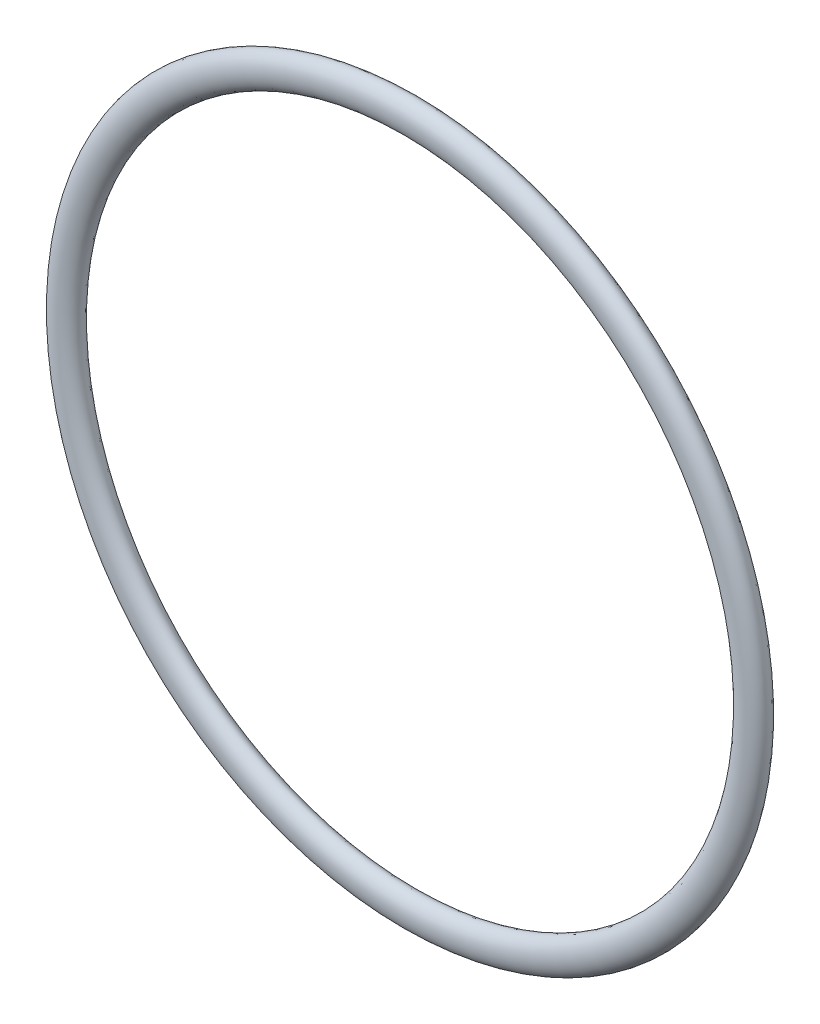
from build123d import *

# Parameters (mm, degrees)
ESQUISSE1_RX = 1.5
ESQUISSE1_RY = 1


with BuildPart() as part:
    # Esquisse1 → Base-R_volution (revolve)
    with BuildSketch(Plane(origin=(0, 0, 0), x_dir=(0, 0, -1), z_dir=(1, 0, 0))):
        with Locations(Location((1, 30.9), (0, 0, -90))):
            Ellipse(ESQUISSE1_RX, ESQUISSE1_RY)
    revolve(axis=Axis((0, 0, 0), (0, 0, -1)))


solid = part.part
